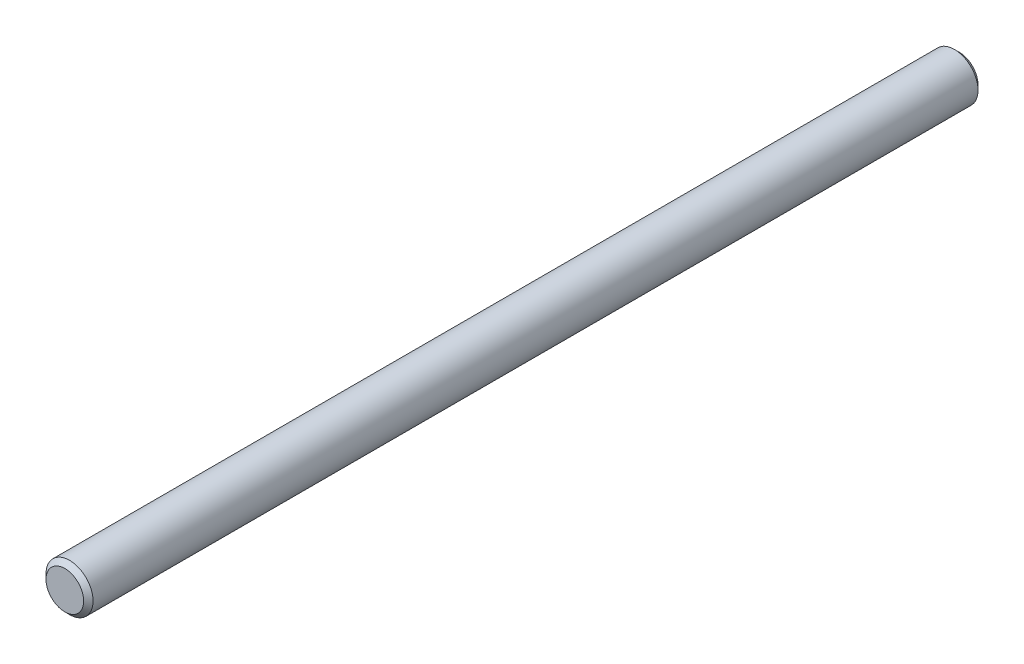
ISO-10303-21;
HEADER;
FILE_DESCRIPTION(('STEP AP214'),'2;1');
FILE_NAME('part.step','',(''),(''),'','','');
FILE_SCHEMA(('AUTOMOTIVE_DESIGN { 1 0 10303 214 1 1 1 1 }'));
ENDSEC;
DATA;
#1=APPLICATION_CONTEXT('core data for automotive mechanical design processes');
#2=APPLICATION_PROTOCOL_DEFINITION('international standard','automotive_design',2000,#1);
#3=PRODUCT_CONTEXT('',#1,'mechanical');
#4=PRODUCT('Part','Part','',(#3));
#5=PRODUCT_RELATED_PRODUCT_CATEGORY('part','',(#4));
#6=PRODUCT_DEFINITION_FORMATION('','',#4);
#7=PRODUCT_DEFINITION_CONTEXT('part definition',#1,'design');
#8=PRODUCT_DEFINITION('design','',#6,#7);
#9=PRODUCT_DEFINITION_SHAPE('','',#8);
#10=(LENGTH_UNIT() NAMED_UNIT(*) SI_UNIT(.MILLI.,.METRE.));
#11=(NAMED_UNIT(*) PLANE_ANGLE_UNIT() SI_UNIT($,.RADIAN.));
#12=(NAMED_UNIT(*) SI_UNIT($,.STERADIAN.) SOLID_ANGLE_UNIT());
#13=UNCERTAINTY_MEASURE_WITH_UNIT(LENGTH_MEASURE(1.E-05),#10,'distance_accuracy_value','');
#14=(GEOMETRIC_REPRESENTATION_CONTEXT(3) GLOBAL_UNCERTAINTY_ASSIGNED_CONTEXT((#13)) GLOBAL_UNIT_ASSIGNED_CONTEXT((#10,
#11,#12)) REPRESENTATION_CONTEXT('',''));
#15=CARTESIAN_POINT('',(0.,0.,0.));
#16=DIRECTION('',(0.,0.,1.));
#17=DIRECTION('',(1.,0.,0.));
#18=AXIS2_PLACEMENT_3D('',#15,#16,#17);
#19=CARTESIAN_POINT('',(0.,0.,57.));
#20=DIRECTION('',(0.,0.,-1.));
#21=DIRECTION('',(-1.,0.,0.));
#22=AXIS2_PLACEMENT_3D('',#19,#20,#21);
#23=CYLINDRICAL_SURFACE('',#22,1.5);
#24=CARTESIAN_POINT('',(0.,0.,0.300000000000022));
#25=DIRECTION('',(0.,0.,1.));
#26=DIRECTION('',(1.,0.,0.));
#27=AXIS2_PLACEMENT_3D('',#24,#25,#26);
#28=CIRCLE('',#27,1.5);
#29=CARTESIAN_POINT('',(-1.5,0.,0.300000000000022));
#30=VERTEX_POINT('',#29);
#31=EDGE_CURVE('E36',#30,#30,#28,.T.);
#32=CARTESIAN_POINT('',(0.,0.,56.7));
#33=DIRECTION('',(0.,0.,1.));
#34=DIRECTION('',(1.,0.,0.));
#35=AXIS2_PLACEMENT_3D('',#32,#33,#34);
#36=CIRCLE('',#35,1.5);
#37=CARTESIAN_POINT('',(-1.5,0.,56.7));
#38=VERTEX_POINT('',#37);
#39=EDGE_CURVE('E40',#38,#38,#36,.F.);
#40=CARTESIAN_POINT('',(-1.5,0.,0.300000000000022));
#41=CARTESIAN_POINT('',(-1.5,0.,0.887500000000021));
#42=CARTESIAN_POINT('',(-1.5,0.,1.47500000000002));
#43=CARTESIAN_POINT('',(-1.5,0.,2.65000000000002));
#44=CARTESIAN_POINT('',(-1.5,0.,3.23750000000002));
#45=CARTESIAN_POINT('',(-1.5,0.,4.41250000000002));
#46=CARTESIAN_POINT('',(-1.5,0.,5.00000000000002));
#47=CARTESIAN_POINT('',(-1.5,0.,6.17500000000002));
#48=CARTESIAN_POINT('',(-1.5,0.,6.76250000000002));
#49=CARTESIAN_POINT('',(-1.5,0.,7.93750000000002));
#50=CARTESIAN_POINT('',(-1.5,0.,8.52500000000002));
#51=CARTESIAN_POINT('',(-1.5,0.,9.70000000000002));
#52=CARTESIAN_POINT('',(-1.5,0.,10.2875));
#53=CARTESIAN_POINT('',(-1.5,0.,11.4625));
#54=CARTESIAN_POINT('',(-1.5,0.,12.05));
#55=CARTESIAN_POINT('',(-1.5,0.,13.225));
#56=CARTESIAN_POINT('',(-1.5,0.,13.8125));
#57=CARTESIAN_POINT('',(-1.5,0.,14.9875));
#58=CARTESIAN_POINT('',(-1.5,0.,15.575));
#59=CARTESIAN_POINT('',(-1.5,0.,16.75));
#60=CARTESIAN_POINT('',(-1.5,0.,17.3375));
#61=CARTESIAN_POINT('',(-1.5,0.,18.5125));
#62=CARTESIAN_POINT('',(-1.5,0.,19.1));
#63=CARTESIAN_POINT('',(-1.5,0.,20.275));
#64=CARTESIAN_POINT('',(-1.5,0.,20.8625));
#65=CARTESIAN_POINT('',(-1.5,0.,22.0375));
#66=CARTESIAN_POINT('',(-1.5,0.,22.625));
#67=CARTESIAN_POINT('',(-1.5,0.,23.8));
#68=CARTESIAN_POINT('',(-1.5,0.,24.3875));
#69=CARTESIAN_POINT('',(-1.5,0.,25.5625));
#70=CARTESIAN_POINT('',(-1.5,0.,26.15));
#71=CARTESIAN_POINT('',(-1.5,0.,27.325));
#72=CARTESIAN_POINT('',(-1.5,0.,27.9125));
#73=CARTESIAN_POINT('',(-1.5,0.,29.0875));
#74=CARTESIAN_POINT('',(-1.5,0.,29.675));
#75=CARTESIAN_POINT('',(-1.5,0.,30.85));
#76=CARTESIAN_POINT('',(-1.5,0.,31.4375));
#77=CARTESIAN_POINT('',(-1.5,0.,32.6125));
#78=CARTESIAN_POINT('',(-1.5,0.,33.2));
#79=CARTESIAN_POINT('',(-1.5,0.,34.375));
#80=CARTESIAN_POINT('',(-1.5,0.,34.9625));
#81=CARTESIAN_POINT('',(-1.5,0.,36.1375));
#82=CARTESIAN_POINT('',(-1.5,0.,36.725));
#83=CARTESIAN_POINT('',(-1.5,0.,37.9));
#84=CARTESIAN_POINT('',(-1.5,0.,38.4875));
#85=CARTESIAN_POINT('',(-1.5,0.,39.6625));
#86=CARTESIAN_POINT('',(-1.5,0.,40.25));
#87=CARTESIAN_POINT('',(-1.5,0.,41.425));
#88=CARTESIAN_POINT('',(-1.5,0.,42.0125));
#89=CARTESIAN_POINT('',(-1.5,0.,43.1875));
#90=CARTESIAN_POINT('',(-1.5,0.,43.775));
#91=CARTESIAN_POINT('',(-1.5,0.,44.95));
#92=CARTESIAN_POINT('',(-1.5,0.,45.5375));
#93=CARTESIAN_POINT('',(-1.5,0.,46.7125));
#94=CARTESIAN_POINT('',(-1.5,0.,47.3));
#95=CARTESIAN_POINT('',(-1.5,0.,48.475));
#96=CARTESIAN_POINT('',(-1.5,0.,49.0625));
#97=CARTESIAN_POINT('',(-1.5,0.,50.2375));
#98=CARTESIAN_POINT('',(-1.5,0.,50.825));
#99=CARTESIAN_POINT('',(-1.5,0.,52.));
#100=CARTESIAN_POINT('',(-1.5,0.,52.5875));
#101=CARTESIAN_POINT('',(-1.5,0.,53.7625));
#102=CARTESIAN_POINT('',(-1.5,0.,54.35));
#103=CARTESIAN_POINT('',(-1.5,0.,55.525));
#104=CARTESIAN_POINT('',(-1.5,0.,56.1125));
#105=CARTESIAN_POINT('',(-1.5,0.,56.7));
#106=B_SPLINE_CURVE_WITH_KNOTS('',3,(#40,#41,#42,#43,#44,#45,#46,#47,#48,#49,#50,#51,#52,#53,
#54,#55,#56,#57,#58,#59,#60,#61,#62,#63,#64,#65,#66,#67,#68,#69,#70,#71,#72,#73,#74,#75,#76,#77,
#78,#79,#80,#81,#82,#83,#84,#85,#86,#87,#88,#89,#90,#91,#92,#93,#94,#95,#96,#97,#98,#99,#100,
#101,#102,#103,#104,#105),.UNSPECIFIED.,.F.,.F.,(4,2,2,2,2,2,2,2,2,2,2,2,2,2,2,2,2,2,2,2,2,2,2,
2,2,2,2,2,2,2,2,2,4),(0.,1.7625,3.525,5.2875,7.05,8.8125,10.575,12.3375,14.1,15.8625,17.625,
19.3875,21.15,22.9125,24.675,26.4375,28.2,29.9625,31.725,33.4875,35.25,37.0125,38.775,40.5375,
42.3,44.0625,45.825,47.5875,49.35,51.1125,52.875,54.6375,56.4),.UNSPECIFIED.);
#107=EDGE_CURVE('BSEAM26',#30,#38,#106,.T.);
#108=ORIENTED_EDGE('',*,*,#31,.T.);
#109=ORIENTED_EDGE('',*,*,#39,.T.);
#110=ORIENTED_EDGE('',*,*,#107,.T.);
#111=ORIENTED_EDGE('',*,*,#107,.F.);
#112=EDGE_LOOP('',(#108,#110,#109,#111));
#113=FACE_BOUND('',#112,.T.);
#114=ADVANCED_FACE('F26',(#113),#23,.T.);
#115=CARTESIAN_POINT('',(0.,0.,57.));
#116=DIRECTION('',(0.,0.,1.));
#117=DIRECTION('',(1.,0.,0.));
#118=AXIS2_PLACEMENT_3D('',#115,#116,#117);
#119=PLANE('',#118);
#120=CARTESIAN_POINT('',(0.,0.,57.));
#121=DIRECTION('',(0.,0.,1.));
#122=DIRECTION('',(1.,0.,0.));
#123=AXIS2_PLACEMENT_3D('',#120,#121,#122);
#124=CIRCLE('',#123,1.20000000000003);
#125=CARTESIAN_POINT('',(-1.20000000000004,0.,57.));
#126=VERTEX_POINT('',#125);
#127=EDGE_CURVE('E10',#126,#126,#124,.T.);
#128=ORIENTED_EDGE('',*,*,#127,.T.);
#129=EDGE_LOOP('',(#128));
#130=FACE_BOUND('',#129,.T.);
#131=ADVANCED_FACE('F59',(#130),#119,.T.);
#132=CARTESIAN_POINT('',(0.,0.,0.));
#133=DIRECTION('',(0.,0.,1.));
#134=DIRECTION('',(1.,0.,0.));
#135=AXIS2_PLACEMENT_3D('',#132,#133,#134);
#136=PLANE('',#135);
#137=CARTESIAN_POINT('',(0.,0.,0.));
#138=DIRECTION('',(0.,0.,1.));
#139=DIRECTION('',(1.,0.,0.));
#140=AXIS2_PLACEMENT_3D('',#137,#138,#139);
#141=CIRCLE('',#140,1.19999999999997);
#142=CARTESIAN_POINT('',(1.19999999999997,0.,0.));
#143=VERTEX_POINT('',#142);
#144=EDGE_CURVE('E32',#143,#143,#141,.F.);
#145=ORIENTED_EDGE('',*,*,#144,.T.);
#146=EDGE_LOOP('',(#145));
#147=FACE_BOUND('',#146,.T.);
#148=ADVANCED_FACE('F55',(#147),#136,.F.);
#149=CARTESIAN_POINT('',(0.,0.,0.300000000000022));
#150=DIRECTION('',(0.,0.,1.));
#151=DIRECTION('',(1.,0.,0.));
#152=AXIS2_PLACEMENT_3D('',#149,#150,#151);
#153=CONICAL_SURFACE('',#152,1.5,0.785398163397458);
#154=ORIENTED_EDGE('',*,*,#144,.F.);
#155=EDGE_LOOP('',(#154));
#156=FACE_BOUND('',#155,.T.);
#157=ORIENTED_EDGE('',*,*,#31,.F.);
#158=EDGE_LOOP('',(#157));
#159=FACE_BOUND('',#158,.T.);
#160=ADVANCED_FACE('F50',(#156,#159),#153,.T.);
#161=CARTESIAN_POINT('',(0.,0.,57.));
#162=DIRECTION('',(0.,0.,-1.));
#163=DIRECTION('',(-1.,0.,0.));
#164=AXIS2_PLACEMENT_3D('',#161,#162,#163);
#165=CONICAL_SURFACE('',#164,1.20000000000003,0.785398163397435);
#166=CARTESIAN_POINT('',(-1.5,0.,56.7));
#167=CARTESIAN_POINT('',(-1.49687500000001,0.,56.703125));
#168=CARTESIAN_POINT('',(-1.49375000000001,0.,56.70625));
#169=CARTESIAN_POINT('',(-1.48750000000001,0.,56.7125));
#170=CARTESIAN_POINT('',(-1.48437500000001,0.,56.715625));
#171=CARTESIAN_POINT('',(-1.47812500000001,0.,56.721875));
#172=CARTESIAN_POINT('',(-1.47500000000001,0.,56.725));
#173=CARTESIAN_POINT('',(-1.46875000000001,0.,56.73125));
#174=CARTESIAN_POINT('',(-1.46562500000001,0.,56.734375));
#175=CARTESIAN_POINT('',(-1.45937500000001,0.,56.740625));
#176=CARTESIAN_POINT('',(-1.45625000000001,0.,56.74375));
#177=CARTESIAN_POINT('',(-1.45000000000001,0.,56.75));
#178=CARTESIAN_POINT('',(-1.44687500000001,0.,56.753125));
#179=CARTESIAN_POINT('',(-1.44062500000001,0.,56.759375));
#180=CARTESIAN_POINT('',(-1.43750000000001,0.,56.7625));
#181=CARTESIAN_POINT('',(-1.43125000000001,0.,56.76875));
#182=CARTESIAN_POINT('',(-1.42812500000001,0.,56.771875));
#183=CARTESIAN_POINT('',(-1.42187500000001,0.,56.778125));
#184=CARTESIAN_POINT('',(-1.41875000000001,0.,56.78125));
#185=CARTESIAN_POINT('',(-1.41250000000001,0.,56.7875));
#186=CARTESIAN_POINT('',(-1.40937500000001,0.,56.790625));
#187=CARTESIAN_POINT('',(-1.40312500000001,0.,56.796875));
#188=CARTESIAN_POINT('',(-1.40000000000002,0.,56.8));
#189=CARTESIAN_POINT('',(-1.39375000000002,0.,56.80625));
#190=CARTESIAN_POINT('',(-1.39062500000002,0.,56.809375));
#191=CARTESIAN_POINT('',(-1.38437500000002,0.,56.815625));
#192=CARTESIAN_POINT('',(-1.38125000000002,0.,56.81875));
#193=CARTESIAN_POINT('',(-1.37500000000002,0.,56.825));
#194=CARTESIAN_POINT('',(-1.37187500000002,0.,56.828125));
#195=CARTESIAN_POINT('',(-1.36562500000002,0.,56.834375));
#196=CARTESIAN_POINT('',(-1.36250000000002,0.,56.8375));
#197=CARTESIAN_POINT('',(-1.35625000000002,0.,56.84375));
#198=CARTESIAN_POINT('',(-1.35312500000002,0.,56.846875));
#199=CARTESIAN_POINT('',(-1.34687500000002,0.,56.853125));
#200=CARTESIAN_POINT('',(-1.34375000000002,0.,56.85625));
#201=CARTESIAN_POINT('',(-1.33750000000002,0.,56.8625));
#202=CARTESIAN_POINT('',(-1.33437500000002,0.,56.865625));
#203=CARTESIAN_POINT('',(-1.32812500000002,0.,56.871875));
#204=CARTESIAN_POINT('',(-1.32500000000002,0.,56.875));
#205=CARTESIAN_POINT('',(-1.31875000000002,0.,56.88125));
#206=CARTESIAN_POINT('',(-1.31562500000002,0.,56.884375));
#207=CARTESIAN_POINT('',(-1.30937500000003,0.,56.890625));
#208=CARTESIAN_POINT('',(-1.30625000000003,0.,56.89375));
#209=CARTESIAN_POINT('',(-1.30000000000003,0.,56.9));
#210=CARTESIAN_POINT('',(-1.29687500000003,0.,56.903125));
#211=CARTESIAN_POINT('',(-1.29062500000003,0.,56.909375));
#212=CARTESIAN_POINT('',(-1.28750000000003,0.,56.9125));
#213=CARTESIAN_POINT('',(-1.28125000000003,0.,56.91875));
#214=CARTESIAN_POINT('',(-1.27812500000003,0.,56.921875));
#215=CARTESIAN_POINT('',(-1.27187500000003,0.,56.928125));
#216=CARTESIAN_POINT('',(-1.26875000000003,0.,56.93125));
#217=CARTESIAN_POINT('',(-1.26250000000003,0.,56.9375));
#218=CARTESIAN_POINT('',(-1.25937500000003,0.,56.940625));
#219=CARTESIAN_POINT('',(-1.25312500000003,0.,56.946875));
#220=CARTESIAN_POINT('',(-1.25000000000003,0.,56.95));
#221=CARTESIAN_POINT('',(-1.24375000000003,0.,56.95625));
#222=CARTESIAN_POINT('',(-1.24062500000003,0.,56.959375));
#223=CARTESIAN_POINT('',(-1.23437500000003,0.,56.965625));
#224=CARTESIAN_POINT('',(-1.23125000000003,0.,56.96875));
#225=CARTESIAN_POINT('',(-1.22500000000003,0.,56.975));
#226=CARTESIAN_POINT('',(-1.22187500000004,0.,56.978125));
#227=CARTESIAN_POINT('',(-1.21562500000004,0.,56.984375));
#228=CARTESIAN_POINT('',(-1.21250000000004,0.,56.9875));
#229=CARTESIAN_POINT('',(-1.20625000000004,0.,56.99375));
#230=CARTESIAN_POINT('',(-1.20312500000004,0.,56.996875));
#231=CARTESIAN_POINT('',(-1.20000000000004,0.,57.));
#232=B_SPLINE_CURVE_WITH_KNOTS('',3,(#166,#167,#168,#169,#170,#171,#172,#173,#174,#175,#176,
#177,#178,#179,#180,#181,#182,#183,#184,#185,#186,#187,#188,#189,#190,#191,#192,#193,#194,#195,
#196,#197,#198,#199,#200,#201,#202,#203,#204,#205,#206,#207,#208,#209,#210,#211,#212,#213,#214,
#215,#216,#217,#218,#219,#220,#221,#222,#223,#224,#225,#226,#227,#228,#229,#230,#231),
.UNSPECIFIED.,.F.,.F.,(4,2,2,2,2,2,2,2,2,2,2,2,2,2,2,2,2,2,2,2,2,2,2,2,2,2,2,2,2,2,2,2,4),(0.,
0.0132582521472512,0.0265165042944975,0.0397747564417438,0.0530330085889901,0.0662912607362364,
0.0795495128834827,0.092807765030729,0.106066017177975,0.119324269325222,0.132582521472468,
0.145840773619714,0.15909902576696,0.172357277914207,0.185615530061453,0.198873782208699,
0.212132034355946,0.225390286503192,0.238648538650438,0.251906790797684,0.265165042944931,
0.278423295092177,0.291681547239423,0.30493979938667,0.318198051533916,0.331456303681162,
0.344714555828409,0.357972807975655,0.371231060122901,0.384489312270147,0.397747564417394,
0.41100581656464,0.424264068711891),.UNSPECIFIED.);
#233=EDGE_CURVE('BSEAM47',#38,#126,#232,.T.);
#234=ORIENTED_EDGE('',*,*,#39,.F.);
#235=ORIENTED_EDGE('',*,*,#127,.F.);
#236=ORIENTED_EDGE('',*,*,#233,.T.);
#237=ORIENTED_EDGE('',*,*,#233,.F.);
#238=EDGE_LOOP('',(#234,#236,#235,#237));
#239=FACE_BOUND('',#238,.T.);
#240=ADVANCED_FACE('F47',(#239),#165,.T.);
#241=CLOSED_SHELL('',(#114,#131,#148,#160,#240));
#242=MANIFOLD_SOLID_BREP('B2',#241);
#243=ADVANCED_BREP_SHAPE_REPRESENTATION('',(#18,#242),#14);
#244=SHAPE_DEFINITION_REPRESENTATION(#9,#243);
ENDSEC;
END-ISO-10303-21;
